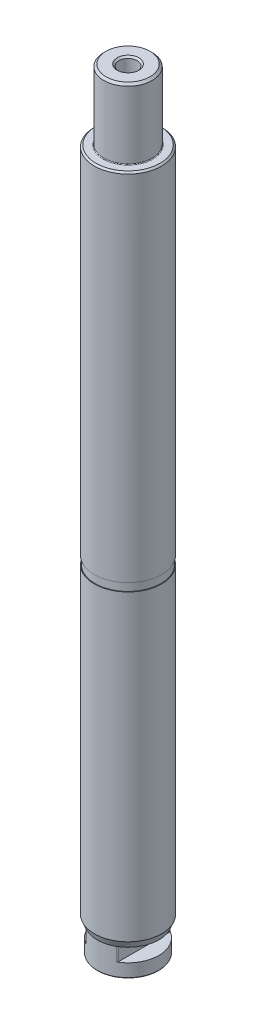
from build123d import *

# Parameters (mm, degrees)
CUT_EXTRUDE_START           = -5
SKETCH_3_OUTSIDE_W          = 84.676
SKETCH_3_OUTSIDE_H          = 84.676
SKETCH_3_OUTSIDE_W_2        = 11.9
SKETCH_3_OUTSIDE_H_2        = 25
CUT_EXTRUDE_1_DEPTH         = 5
FILLET_1_R                  = 0.25
CHAMFER_1_SIZE              = 0.6
CHAMFER_2_SIZE              = 0.8
HOLE_WIZARD_M81_D           = 6.8
HOLE_WIZARD_M81_DEPTH       = 29
HOLE_WIZARD_M81_CSINK_D     = 8.05
HOLE_WIZARD_M81_CSINK_ANGLE = 90
HOLE_WIZARD_M81_TIP         = 2.042926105
FILLET_2_R                  = 0.6


with BuildPart() as part:
    # Sketch 1 → Revolve 1 (revolve)
    with BuildSketch(Plane.XY, mode=Mode.PRIVATE) as revolve_1_sk:
        Polygon((11.45, 0), (11.45, 10), (12.5, 12.5), (12.5, 125.1), (12.25, 125.1), (12.25, 128.1), (12.5, 128.1), (12.5, 260.2), (9, 260.2), (9, 286.2), (0, 286.2), (0, 0), align=None)
    revolve(revolve_1_sk.sketch.rotate(Axis((0, 0, 0), (0, 1, 0)), 90), axis=Axis((0, 0, 0), (0, 1, 0)))

    # Sketch 3 outside → Cut-Extrude 1 (cut)
    with BuildSketch(Plane.XZ.offset(CUT_EXTRUDE_START)):
        Rectangle(SKETCH_3_OUTSIDE_W, SKETCH_3_OUTSIDE_H)
        Rectangle(SKETCH_3_OUTSIDE_W_2, SKETCH_3_OUTSIDE_H_2, mode=Mode.SUBTRACT)
    extrude(amount=-CUT_EXTRUDE_1_DEPTH, mode=Mode.SUBTRACT)

    # Fillet 1
    fillet_1_edges = [part.edges().sort_by_distance(p)[0] for p in [
        (0, 260.2, 9),
        (0, 0, 11.45),
    ]]
    fillet(fillet_1_edges, radius=FILLET_1_R)

    # Chamfer 1
    chamfer_1_edges = [part.edges().sort_by_distance(p)[0] for p in [
        (0, 260.2, 12.5),
    ]]
    chamfer(chamfer_1_edges, length=CHAMFER_1_SIZE)

    # Chamfer 2
    chamfer_2_edges = [part.edges().sort_by_distance(p)[0] for p in [
        (0, 286.2, 9),
    ]]
    chamfer(chamfer_2_edges, length=CHAMFER_2_SIZE)

    # Hole Wizard M81
    with Locations(Plane(origin=(0, 286.2, 0), x_dir=(1, 0, 0), z_dir=(0, 1, 0))):
        with Locations((0, 0)):
            CounterSinkHole(HOLE_WIZARD_M81_D / 2, HOLE_WIZARD_M81_CSINK_D / 2, depth=HOLE_WIZARD_M81_DEPTH, counter_sink_angle=HOLE_WIZARD_M81_CSINK_ANGLE)
            with Locations((0, 0, -(HOLE_WIZARD_M81_DEPTH + HOLE_WIZARD_M81_TIP / 2))):  # 118° drill point
                Cone(0, HOLE_WIZARD_M81_D / 2, HOLE_WIZARD_M81_TIP, mode=Mode.SUBTRACT)

    # Fillet 2
    fillet_2_edges = [part.edges().sort_by_distance(p)[0] for p in [
        (-5.95, 7.5, -9.782637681),
        (-5.95, 7.5, 9.782637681),
        (5.95, 7.5, 9.782637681),
        (5.95, 7.5, -9.782637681),
    ]]
    fillet(fillet_2_edges, radius=FILLET_2_R)


solid = part.part
